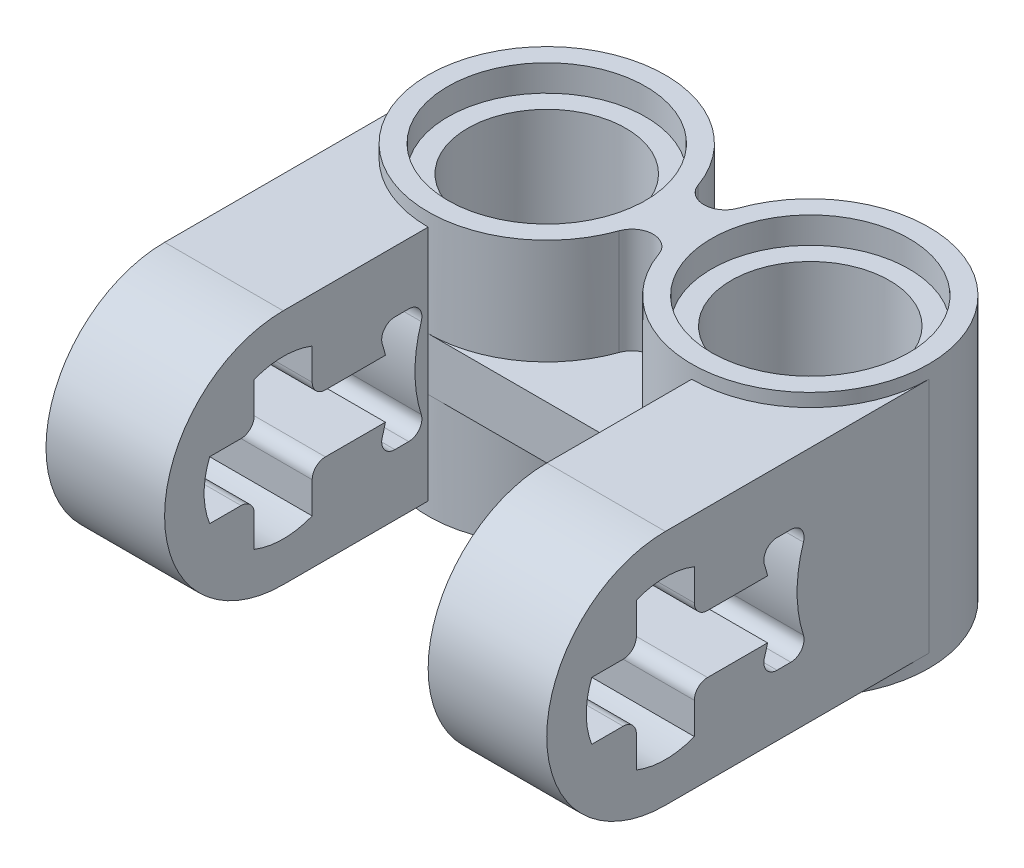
from build123d import *
from build123d.topology import SkipClean

# Parameters (mm, degrees)
BOSS_EXTRUDE1_DEPTH      = 4
BOSS_EXTRUDE1_DEPTH_BACK = 4
SKETCH1_R                = 2.4
CUT_EXTRUDE1_START       = -3.2
CUT_EXTRUDE1_DEPTH       = 3.2
SKETCH3_R                = 3
CUT_EXTRUDE2_DEPTH       = 0.8
BOSS_EXTRUDE2_DEPTH      = 8
BOSS_EXTRUDE2_2_DEPTH    = 8
BOSS_EXTRUDE4_DEPTH      = 3.6
BOSS_EXTRUDE5_START      = -3.6
BOSS_EXTRUDE5_DEPTH      = 3.6
CUT_EXTRUDE3_DEPTH       = 20.774731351
BOSS_EXTRUDE6_START      = -7.6
BOSS_EXTRUDE6_DEPTH      = 7.6
CUT_EXTRUDE4_REACH       = 21.535


with BuildPart() as part:
    # Sketch1 → Boss-Extrude1 (new, two sides: drawn at the far end of the back side and taken through both)
    with BuildSketch(Plane(origin=(0, 0, 0), x_dir=(1, 0, 0), z_dir=(0, 1, 0)).offset(-BOSS_EXTRUDE1_DEPTH_BACK)):
        with BuildLine():
            Line((0, 3.6), (8, 3.6))
            ThreePointArc((8, 3.6), (11.6, 0), (8, -3.6))
            Line((8, -3.6), (0, -3.6))
            ThreePointArc((0, -3.6), (-3.6, 0), (0, 3.6))
        make_face()
        with Locations(Location((0, 0, 0), (0, 0, 270))):
            Circle(SKETCH1_R, mode=Mode.SUBTRACT)
        with Locations(Location((8, 0, 0), (0, 0, 270))):
            Circle(SKETCH1_R, mode=Mode.SUBTRACT)
    extrude(amount=BOSS_EXTRUDE1_DEPTH + BOSS_EXTRUDE1_DEPTH_BACK)

    # Sketch2 → Cut-Extrude1 (cut)
    with SkipClean():  # the faces are left unmerged after this step: merging them gives an invalid solid
        with BuildSketch(Plane(origin=(0, 4, 0), x_dir=(1, 0, 0), z_dir=(0, 1, 0)).offset(CUT_EXTRUDE1_START)):
            with BuildLine():
                Line((0, 3.6), (8, 3.6))
                ThreePointArc((8, 3.6), (5.921539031, 2.939387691), (4.60588745, 1.2))
                ThreePointArc((4.60588745, 1.2), (4, 0.771572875), (3.39411255, 1.2))
                ThreePointArc((3.39411255, 1.2), (2.078460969, 2.939387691), (0, 3.6))
            make_face()
            with BuildLine():
                Line((8, -3.6), (0, -3.6))
                ThreePointArc((0, -3.6), (2.078460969, -2.939387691), (3.39411255, -1.2))
                ThreePointArc((3.39411255, -1.2), (4, -0.771572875), (4.60588745, -1.2))
                ThreePointArc((4.60588745, -1.2), (5.921539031, -2.939387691), (8, -3.6))
            make_face()
        cut_extrude1 = extrude(amount=CUT_EXTRUDE1_DEPTH, mode=Mode.SUBTRACT)

    # Mirror1: Cut-Extrude1 across plane
    with SkipClean():  # the faces are left unmerged after this step: merging them gives an invalid solid
        add(cut_extrude1.mirror(Plane.ZX), mode=Mode.SUBTRACT)

    # Sketch3 → Cut-Extrude2 (cut)
    with SkipClean():  # the faces are left unmerged after this step: merging them gives an invalid solid
        with BuildSketch(Plane(origin=(0, 4, 0), x_dir=(1, 0, 0), z_dir=(0, 1, 0))):
            with Locations(Location((0, 0, 0), (0, 0, 270))):
                Circle(SKETCH3_R)
            with Locations(Location((8, 0, 0), (0, 0, 270))):
                Circle(SKETCH3_R)
        cut_extrude2 = extrude(amount=-CUT_EXTRUDE2_DEPTH, mode=Mode.SUBTRACT)

    # Mirror2: Cut-Extrude2 across plane
    with SkipClean():  # the faces are left unmerged after this step: merging them gives an invalid solid
        add(cut_extrude2.mirror(Plane.ZX), mode=Mode.SUBTRACT)



with BuildPart() as body_2:
    # Sketch4 → Boss-Extrude2 (new body)
    with BuildSketch(Plane(origin=(0, 4, 0), x_dir=(1, 0, 0), z_dir=(0, 1, 0))):
        with BuildLine():
            Line((8, -3.6), (11.6, -3.6))
            Line((11.6, -3.6), (11.6, 0))
            ThreePointArc((11.6, 0), (10.545584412, -2.545584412), (8, -3.6))
        make_face()
    extrude(amount=-BOSS_EXTRUDE2_DEPTH)


with BuildPart() as body_3:
    # Sketch4 → Boss-Extrude2 2 (new body)
    with BuildSketch(Plane(origin=(0, 4, 0), x_dir=(1, 0, 0), z_dir=(0, 1, 0))):
        with BuildLine():
            Line((0, -3.6), (-3.6, -3.6))
            Line((-3.6, -3.6), (-3.6, 0))
            ThreePointArc((-3.6, 0), (-2.545584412, -2.545584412), (0, -3.6))
        make_face()
    extrude(amount=-BOSS_EXTRUDE2_2_DEPTH)


with BuildPart() as part_1:
    with SkipClean():  # the faces are left unmerged after this step: merging them gives an invalid solid
        add(part.part)

        add(body_2.part)  # Boss-Extrude4 merges body 2
        # Sketch5 → Boss-Extrude4 (add)
        with BuildSketch(Plane(origin=(11.6, 0, 0), x_dir=(0, 0, -1), z_dir=(1, 0, 0))):
            with BuildLine():
                Line((-3.6, 4), (-3.6, -4))
                Line((-3.6, -4), (-8, -4))
                ThreePointArc((-8, -4), (-12, 0), (-8, 4))
                Line((-8, 4), (-3.6, 4))
            make_face()
            with BuildLine():
                Line((-8.88, 2.232845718), (-8.88, 1.28))
                ThreePointArc((-8.88, 1.28), (-8.997157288, 0.997157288), (-9.28, 0.88))
                Line((-9.28, 0.88), (-10.232845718, 0.88))
                ThreePointArc((-10.232845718, 0.88), (-10.4, 0), (-10.232845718, -0.88))
                Line((-10.232845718, -0.88), (-9.28, -0.88))
                ThreePointArc((-9.28, -0.88), (-8.997157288, -0.997157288), (-8.88, -1.28))
                Line((-8.88, -1.28), (-8.88, -2.232845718))
                ThreePointArc((-8.88, -2.232845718), (-8, -2.4), (-7.12, -2.232845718))
                Line((-7.12, -2.232845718), (-7.12, -1.28))
                ThreePointArc((-7.12, -1.28), (-7.002842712, -0.997157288), (-6.72, -0.88))
                Line((-6.72, -0.88), (-5.767154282, -0.88))
                ThreePointArc((-5.767154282, -0.88), (-5.6, 0), (-5.767154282, 0.88))
                Line((-5.767154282, 0.88), (-6.72, 0.88))
                ThreePointArc((-6.72, 0.88), (-7.002842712, 0.997157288), (-7.12, 1.28))
                Line((-7.12, 1.28), (-7.12, 2.232845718))
                ThreePointArc((-7.12, 2.232845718), (-8, 2.4), (-8.88, 2.232845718))
            make_face(mode=Mode.SUBTRACT)
        extrude(amount=-BOSS_EXTRUDE4_DEPTH)


    with SkipClean():  # the faces are left unmerged after this step: merging them gives an invalid solid
        add(body_3.part)  # Boss-Extrude5 merges body 3
        # Sketch7 → Boss-Extrude5 (add)
        with BuildSketch(Plane.ZY.offset(3.6).offset(BOSS_EXTRUDE5_START)):
            with BuildLine():
                Line((3.6, 4), (3.6, -4))
                Line((3.6, -4), (8, -4))
                ThreePointArc((8, -4), (12, 0), (8, 4))
                Line((8, 4), (3.6, 4))
            make_face()
            with BuildLine():
                Line((7.12, 2.232845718), (7.12, 1.28))
                ThreePointArc((7.12, 1.28), (7.002842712, 0.997157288), (6.72, 0.88))
                Line((6.72, 0.88), (5.767154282, 0.88))
                ThreePointArc((5.767154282, 0.88), (5.6, 0), (5.767154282, -0.88))
                Line((5.767154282, -0.88), (6.72, -0.88))
                ThreePointArc((6.72, -0.88), (7.002842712, -0.997157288), (7.12, -1.28))
                Line((7.12, -1.28), (7.12, -2.232845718))
                ThreePointArc((7.12, -2.232845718), (8, -2.4), (8.88, -2.232845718))
                Line((8.88, -2.232845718), (8.88, -1.28))
                ThreePointArc((8.88, -1.28), (8.997157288, -0.997157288), (9.28, -0.88))
                Line((9.28, -0.88), (10.232845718, -0.88))
                ThreePointArc((10.232845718, -0.88), (10.4, 0), (10.232845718, 0.88))
                Line((10.232845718, 0.88), (9.28, 0.88))
                ThreePointArc((9.28, 0.88), (8.997157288, 0.997157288), (8.88, 1.28))
                Line((8.88, 1.28), (8.88, 2.232845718))
                ThreePointArc((8.88, 2.232845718), (8, 2.4), (7.12, 2.232845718))
            make_face(mode=Mode.SUBTRACT)
        extrude(amount=BOSS_EXTRUDE5_DEPTH)

    # Sketch8 → Cut-Extrude3 (cut, through all)
    with SkipClean():  # the faces are left unmerged after this step: merging them gives an invalid solid
        with BuildSketch(Plane.ZY.offset(3.6)):
            with BuildLine():
                Line((8, 3.6), (0, 3.6))
                Line((0, 3.6), (0, 4))
                Line((0, 4), (8, 4))
                ThreePointArc((8, 4), (12, 0), (8, -4))
                Line((8, -4), (0, -4))
                Line((0, -4), (0, -3.6))
                Line((0, -3.6), (8, -3.6))
                ThreePointArc((8, -3.6), (11.6, 0), (8, 3.6))
            make_face()
        extrude(amount=-CUT_EXTRUDE3_DEPTH, mode=Mode.SUBTRACT)

    # Sketch10 → Boss-Extrude6 (add)
    with SkipClean():  # the faces are left unmerged after this step: merging them gives an invalid solid
        with BuildSketch(Plane(origin=(0, 4, 0), x_dir=(1, 0, 0), z_dir=(0, 1, 0)).offset(BOSS_EXTRUDE6_START)):
            with BuildLine():
                Line((-3.6, 0), (-3, 0))
                ThreePointArc((-3, 0), (0, -3), (3, 0))
                Line((3, 0), (5, 0))
                ThreePointArc((5, 0), (8, -3), (11, 0))
                Line((11, 0), (11.6, 0))
                ThreePointArc((11.6, 0), (8.608767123, -3.548154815), (4.60588745, -1.2))
                ThreePointArc((4.60588745, -1.2), (4, -0.771572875), (3.39411255, -1.2))
                ThreePointArc((3.39411255, -1.2), (-0.608767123, -3.548154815), (-3.6, 0))
            make_face()
        boss_extrude6 = extrude(amount=BOSS_EXTRUDE6_DEPTH)

    # Mirror4: Boss-Extrude6 across plane
    with SkipClean():  # the faces are left unmerged after this step: merging them gives an invalid solid
        add(boss_extrude6.mirror(Plane.ZX))

    # Cut-Extrude4: up to this face of the body (flat: up to its plane)
    cut_extrude4_end = Plane(part_1.part.faces().sort_by_distance((11.6, 3.492371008, 5.8))[0])
    # Sketch11 → Cut-Extrude4 (cut, up to the picked face)
    with BuildSketch(Plane.ZY.offset(3.6), mode=Mode.PRIVATE) as cut_extrude4_sk1:
        with BuildLine():
            Line((5.767154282, 0.88), (4.898000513, 0.88))
            ThreePointArc((4.898000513, 0.88), (4.940745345, 1.051738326), (4.991044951, 1.221417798))
            ThreePointArc((4.991044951, 1.221417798), (4.933303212, 1.579295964), (4.610149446, 1.743559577))
            Line((4.610149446, 1.743559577), (4.189850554, 1.743559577))
            ThreePointArc((4.189850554, 1.743559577), (3.866696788, 1.579295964), (3.808955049, 1.221417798))
            ThreePointArc((3.808955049, 1.221417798), (4, 0), (3.808955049, -1.221417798))
            ThreePointArc((3.808955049, -1.221417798), (3.866696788, -1.579295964), (4.189850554, -1.743559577))
            Line((4.189850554, -1.743559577), (4.610149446, -1.743559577))
            ThreePointArc((4.610149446, -1.743559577), (4.933303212, -1.579295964), (4.991044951, -1.221417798))
            ThreePointArc((4.991044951, -1.221417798), (4.940745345, -1.051738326), (4.898000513, -0.88))
            Line((4.898000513, -0.88), (5.767154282, -0.88))
            ThreePointArc((5.767154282, -0.88), (5.6, 0), (5.767154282, 0.88))
        make_face()
    cut_extrude4_tool1 = split(extrude(cut_extrude4_sk1.sketch, amount=-CUT_EXTRUDE4_REACH, mode=Mode.PRIVATE), bisect_by=cut_extrude4_end, keep=Keep.BOTH, mode=Mode.PRIVATE)
    add(cut_extrude4_tool1.solids().sort_by(Axis((-3.6, 0, 4.652418), (1, 0, 0)))[0], mode=Mode.SUBTRACT)


solid = part_1.part
